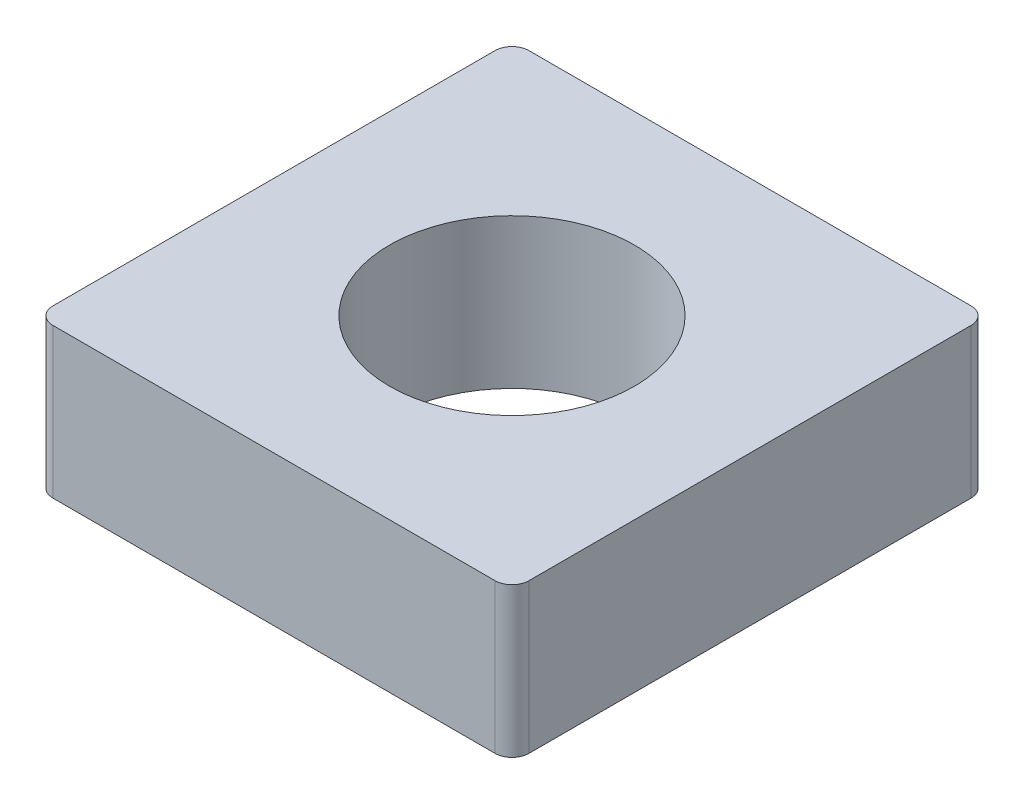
from build123d import *

# Parameters (mm, degrees)
SKETCH1_W           = 7
SKETCH1_H           = 7
SKETCH1_R           = 1.8
BOSS_EXTRUDE1_DEPTH = 2.2
FILLET1_R           = 0.25


with BuildPart() as part:
    # Sketch1 → Boss-Extrude1 (new body)
    with BuildSketch(Plane(origin=(0, 0, 0), x_dir=(1, 0, 0), z_dir=(0, 1, 0))):
        Rectangle(SKETCH1_W, SKETCH1_H)
        with Locations(Location((0, 0, 0), (0, 0, 270))):
            Circle(SKETCH1_R, mode=Mode.SUBTRACT)
    extrude(amount=BOSS_EXTRUDE1_DEPTH)

    # Fillet1
    fillet1_edges = [part.edges().sort_by_distance(p)[0] for p in [
        (-3.5, 1.1, -3.5),
        (3.5, 1.1, -3.5),
        (3.5, 1.1, 3.5),
        (-3.5, 1.1, 3.5),
    ]]
    fillet(fillet1_edges, radius=FILLET1_R)


solid = part.part
